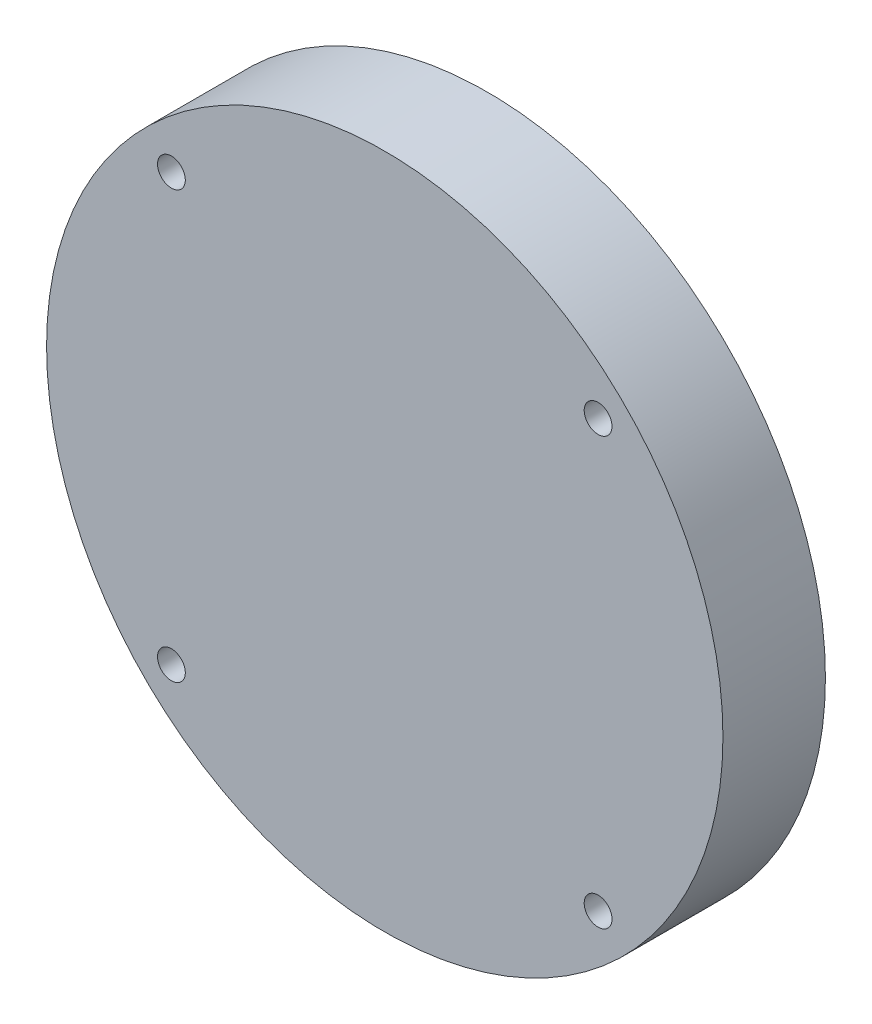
ISO-10303-21;
HEADER;
FILE_DESCRIPTION(('STEP AP214'),'2;1');
FILE_NAME('part.step','',(''),(''),'','','');
FILE_SCHEMA(('AUTOMOTIVE_DESIGN { 1 0 10303 214 1 1 1 1 }'));
ENDSEC;
DATA;
#1=APPLICATION_CONTEXT('core data for automotive mechanical design processes');
#2=APPLICATION_PROTOCOL_DEFINITION('international standard','automotive_design',2000,#1);
#3=PRODUCT_CONTEXT('',#1,'mechanical');
#4=PRODUCT('Part','Part','',(#3));
#5=PRODUCT_RELATED_PRODUCT_CATEGORY('part','',(#4));
#6=PRODUCT_DEFINITION_FORMATION('','',#4);
#7=PRODUCT_DEFINITION_CONTEXT('part definition',#1,'design');
#8=PRODUCT_DEFINITION('design','',#6,#7);
#9=PRODUCT_DEFINITION_SHAPE('','',#8);
#10=(LENGTH_UNIT() NAMED_UNIT(*) SI_UNIT(.MILLI.,.METRE.));
#11=(NAMED_UNIT(*) PLANE_ANGLE_UNIT() SI_UNIT($,.RADIAN.));
#12=(NAMED_UNIT(*) SI_UNIT($,.STERADIAN.) SOLID_ANGLE_UNIT());
#13=UNCERTAINTY_MEASURE_WITH_UNIT(LENGTH_MEASURE(1.E-05),#10,'distance_accuracy_value','');
#14=(GEOMETRIC_REPRESENTATION_CONTEXT(3) GLOBAL_UNCERTAINTY_ASSIGNED_CONTEXT((#13)) GLOBAL_UNIT_ASSIGNED_CONTEXT((#10,
#11,#12)) REPRESENTATION_CONTEXT('',''));
#15=CARTESIAN_POINT('',(0.,0.,0.));
#16=DIRECTION('',(0.,0.,1.));
#17=DIRECTION('',(1.,0.,0.));
#18=AXIS2_PLACEMENT_3D('',#15,#16,#17);
#19=CARTESIAN_POINT('',(0.,0.,15.875));
#20=DIRECTION('',(0.,0.,-1.));
#21=DIRECTION('',(-1.,0.,0.));
#22=AXIS2_PLACEMENT_3D('',#19,#20,#21);
#23=CYLINDRICAL_SURFACE('',#22,52.3875);
#24=CARTESIAN_POINT('',(0.,0.,15.875));
#25=DIRECTION('',(0.,0.,1.));
#26=DIRECTION('',(1.,0.,0.));
#27=AXIS2_PLACEMENT_3D('',#24,#25,#26);
#28=CIRCLE('',#27,52.3875);
#29=CARTESIAN_POINT('',(52.3875,0.,15.875));
#30=VERTEX_POINT('',#29);
#31=EDGE_CURVE('E10',#30,#30,#28,.T.);
#32=ORIENTED_EDGE('',*,*,#31,.F.);
#33=EDGE_LOOP('',(#32));
#34=FACE_BOUND('',#33,.T.);
#35=CARTESIAN_POINT('',(0.,0.,0.));
#36=DIRECTION('',(0.,0.,1.));
#37=DIRECTION('',(1.,0.,0.));
#38=AXIS2_PLACEMENT_3D('',#35,#36,#37);
#39=CIRCLE('',#38,52.3875);
#40=CARTESIAN_POINT('',(52.3875,0.,0.));
#41=VERTEX_POINT('',#40);
#42=EDGE_CURVE('E38',#41,#41,#39,.T.);
#43=ORIENTED_EDGE('',*,*,#42,.T.);
#44=EDGE_LOOP('',(#43));
#45=FACE_BOUND('',#44,.T.);
#46=ADVANCED_FACE('F35',(#34,#45),#23,.T.);
#47=CARTESIAN_POINT('',(0.,0.,15.875));
#48=DIRECTION('',(0.,0.,1.));
#49=DIRECTION('',(1.,0.,0.));
#50=AXIS2_PLACEMENT_3D('',#47,#48,#49);
#51=PLANE('',#50);
#52=CARTESIAN_POINT('',(-33.0473425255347,33.0473425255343,15.875));
#53=DIRECTION('',(0.,0.,1.));
#54=DIRECTION('',(1.,0.,0.));
#55=AXIS2_PLACEMENT_3D('',#52,#53,#54);
#56=CIRCLE('',#55,2.15265);
#57=CARTESIAN_POINT('',(-30.8946925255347,33.0473425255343,15.875));
#58=VERTEX_POINT('',#57);
#59=EDGE_CURVE('E67',#58,#58,#56,.T.);
#60=ORIENTED_EDGE('',*,*,#59,.F.);
#61=EDGE_LOOP('',(#60));
#62=FACE_BOUND('',#61,.T.);
#63=CARTESIAN_POINT('',(33.0473425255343,33.0473425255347,15.875));
#64=DIRECTION('',(0.,0.,1.));
#65=DIRECTION('',(1.,0.,0.));
#66=AXIS2_PLACEMENT_3D('',#63,#64,#65);
#67=CIRCLE('',#66,2.15265);
#68=CARTESIAN_POINT('',(35.1999925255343,33.0473425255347,15.875));
#69=VERTEX_POINT('',#68);
#70=EDGE_CURVE('E61',#69,#69,#67,.T.);
#71=ORIENTED_EDGE('',*,*,#70,.F.);
#72=EDGE_LOOP('',(#71));
#73=FACE_BOUND('',#72,.T.);
#74=CARTESIAN_POINT('',(33.0473425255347,-33.0473425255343,15.875));
#75=DIRECTION('',(0.,0.,1.));
#76=DIRECTION('',(1.,0.,0.));
#77=AXIS2_PLACEMENT_3D('',#74,#75,#76);
#78=CIRCLE('',#77,2.15265);
#79=CARTESIAN_POINT('',(35.1999925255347,-33.0473425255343,15.875));
#80=VERTEX_POINT('',#79);
#81=EDGE_CURVE('E55',#80,#80,#78,.T.);
#82=ORIENTED_EDGE('',*,*,#81,.F.);
#83=EDGE_LOOP('',(#82));
#84=FACE_BOUND('',#83,.T.);
#85=CARTESIAN_POINT('',(-33.0473425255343,-33.0473425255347,15.875));
#86=DIRECTION('',(0.,0.,1.));
#87=DIRECTION('',(1.,0.,0.));
#88=AXIS2_PLACEMENT_3D('',#85,#86,#87);
#89=CIRCLE('',#88,2.15265);
#90=CARTESIAN_POINT('',(-30.8946925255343,-33.0473425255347,15.875));
#91=VERTEX_POINT('',#90);
#92=EDGE_CURVE('E49',#91,#91,#89,.T.);
#93=ORIENTED_EDGE('',*,*,#92,.F.);
#94=EDGE_LOOP('',(#93));
#95=FACE_BOUND('',#94,.T.);
#96=ORIENTED_EDGE('',*,*,#31,.T.);
#97=EDGE_LOOP('',(#96));
#98=FACE_BOUND('',#97,.T.);
#99=ADVANCED_FACE('F73',(#62,#73,#84,#95,#98),#51,.T.);
#100=CARTESIAN_POINT('',(0.,0.,0.));
#101=DIRECTION('',(0.,0.,1.));
#102=DIRECTION('',(1.,0.,0.));
#103=AXIS2_PLACEMENT_3D('',#100,#101,#102);
#104=PLANE('',#103);
#105=CARTESIAN_POINT('',(-33.0473425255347,33.0473425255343,0.));
#106=DIRECTION('',(0.,0.,1.));
#107=DIRECTION('',(1.,0.,0.));
#108=AXIS2_PLACEMENT_3D('',#105,#106,#107);
#109=CIRCLE('',#108,2.15265);
#110=CARTESIAN_POINT('',(-30.8946925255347,33.0473425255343,0.));
#111=VERTEX_POINT('',#110);
#112=EDGE_CURVE('E64',#111,#111,#109,.T.);
#113=ORIENTED_EDGE('',*,*,#112,.T.);
#114=EDGE_LOOP('',(#113));
#115=FACE_BOUND('',#114,.T.);
#116=CARTESIAN_POINT('',(33.0473425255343,33.0473425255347,0.));
#117=DIRECTION('',(0.,0.,1.));
#118=DIRECTION('',(1.,0.,0.));
#119=AXIS2_PLACEMENT_3D('',#116,#117,#118);
#120=CIRCLE('',#119,2.15265);
#121=CARTESIAN_POINT('',(35.1999925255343,33.0473425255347,0.));
#122=VERTEX_POINT('',#121);
#123=EDGE_CURVE('E58',#122,#122,#120,.T.);
#124=ORIENTED_EDGE('',*,*,#123,.T.);
#125=EDGE_LOOP('',(#124));
#126=FACE_BOUND('',#125,.T.);
#127=CARTESIAN_POINT('',(33.0473425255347,-33.0473425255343,0.));
#128=DIRECTION('',(0.,0.,1.));
#129=DIRECTION('',(1.,0.,0.));
#130=AXIS2_PLACEMENT_3D('',#127,#128,#129);
#131=CIRCLE('',#130,2.15265);
#132=CARTESIAN_POINT('',(35.1999925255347,-33.0473425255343,0.));
#133=VERTEX_POINT('',#132);
#134=EDGE_CURVE('E52',#133,#133,#131,.T.);
#135=ORIENTED_EDGE('',*,*,#134,.T.);
#136=EDGE_LOOP('',(#135));
#137=FACE_BOUND('',#136,.T.);
#138=CARTESIAN_POINT('',(-33.0473425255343,-33.0473425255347,0.));
#139=DIRECTION('',(0.,0.,1.));
#140=DIRECTION('',(1.,0.,0.));
#141=AXIS2_PLACEMENT_3D('',#138,#139,#140);
#142=CIRCLE('',#141,2.15265);
#143=CARTESIAN_POINT('',(-30.8946925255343,-33.0473425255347,0.));
#144=VERTEX_POINT('',#143);
#145=EDGE_CURVE('E45',#144,#144,#142,.T.);
#146=ORIENTED_EDGE('',*,*,#145,.T.);
#147=EDGE_LOOP('',(#146));
#148=FACE_BOUND('',#147,.T.);
#149=ORIENTED_EDGE('',*,*,#42,.F.);
#150=EDGE_LOOP('',(#149));
#151=FACE_BOUND('',#150,.T.);
#152=ADVANCED_FACE('F76',(#115,#126,#137,#148,#151),#104,.F.);
#153=CARTESIAN_POINT('',(-33.0473425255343,-33.0473425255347,15.875));
#154=DIRECTION('',(0.,0.,1.));
#155=DIRECTION('',(1.,0.,0.));
#156=AXIS2_PLACEMENT_3D('',#153,#154,#155);
#157=CYLINDRICAL_SURFACE('',#156,2.15265);
#158=ORIENTED_EDGE('',*,*,#145,.F.);
#159=EDGE_LOOP('',(#158));
#160=FACE_BOUND('',#159,.T.);
#161=ORIENTED_EDGE('',*,*,#92,.T.);
#162=EDGE_LOOP('',(#161));
#163=FACE_BOUND('',#162,.T.);
#164=ADVANCED_FACE('F84',(#160,#163),#157,.F.);
#165=CARTESIAN_POINT('',(33.0473425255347,-33.0473425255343,15.875));
#166=DIRECTION('',(0.,0.,1.));
#167=DIRECTION('',(1.,0.,0.));
#168=AXIS2_PLACEMENT_3D('',#165,#166,#167);
#169=CYLINDRICAL_SURFACE('',#168,2.15265);
#170=ORIENTED_EDGE('',*,*,#134,.F.);
#171=EDGE_LOOP('',(#170));
#172=FACE_BOUND('',#171,.T.);
#173=ORIENTED_EDGE('',*,*,#81,.T.);
#174=EDGE_LOOP('',(#173));
#175=FACE_BOUND('',#174,.T.);
#176=ADVANCED_FACE('F86',(#172,#175),#169,.F.);
#177=CARTESIAN_POINT('',(33.0473425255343,33.0473425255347,15.875));
#178=DIRECTION('',(0.,0.,1.));
#179=DIRECTION('',(1.,0.,0.));
#180=AXIS2_PLACEMENT_3D('',#177,#178,#179);
#181=CYLINDRICAL_SURFACE('',#180,2.15265);
#182=ORIENTED_EDGE('',*,*,#123,.F.);
#183=EDGE_LOOP('',(#182));
#184=FACE_BOUND('',#183,.T.);
#185=ORIENTED_EDGE('',*,*,#70,.T.);
#186=EDGE_LOOP('',(#185));
#187=FACE_BOUND('',#186,.T.);
#188=ADVANCED_FACE('F93',(#184,#187),#181,.F.);
#189=CARTESIAN_POINT('',(-33.0473425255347,33.0473425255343,15.875));
#190=DIRECTION('',(0.,0.,1.));
#191=DIRECTION('',(1.,0.,0.));
#192=AXIS2_PLACEMENT_3D('',#189,#190,#191);
#193=CYLINDRICAL_SURFACE('',#192,2.15265);
#194=ORIENTED_EDGE('',*,*,#112,.F.);
#195=EDGE_LOOP('',(#194));
#196=FACE_BOUND('',#195,.T.);
#197=ORIENTED_EDGE('',*,*,#59,.T.);
#198=EDGE_LOOP('',(#197));
#199=FACE_BOUND('',#198,.T.);
#200=ADVANCED_FACE('F71',(#196,#199),#193,.F.);
#201=CLOSED_SHELL('',(#46,#99,#152,#164,#176,#188,#200));
#202=MANIFOLD_SOLID_BREP('B2',#201);
#203=ADVANCED_BREP_SHAPE_REPRESENTATION('',(#18,#202),#14);
#204=SHAPE_DEFINITION_REPRESENTATION(#9,#203);
ENDSEC;
END-ISO-10303-21;
